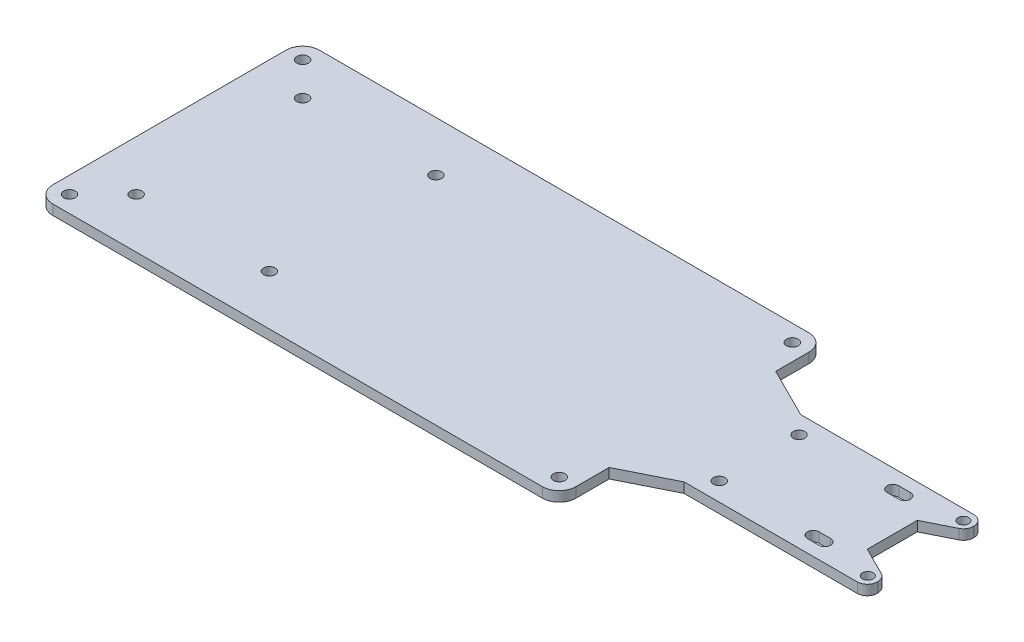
from build123d import *

# Parameters (mm, degrees)
SKETCH1_R               = 1.6
BOSS_EXTRUDE1_DEPTH     = 3
FILLET1_R               = 5
CUT_EXTRUDE1_DEPTH      = 231.516810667
CUT_EXTRUDE1_DEPTH_BACK = 231.516810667
SKETCH2_R               = 1.75
SKETCH3_R               = 1.75
CUT_EXTRUDE2_DEPTH      = 10
SKETCH4_R               = 1.75
CUT_EXTRUDE3_DEPTH      = 10


with BuildPart() as part:
    # Sketch1 → Boss-Extrude1 (new body)
    with BuildSketch(Plane(origin=(0, 0, 0), x_dir=(1, 0, 0), z_dir=(0, 1, 0))):
        with BuildLine():
            Line((0, -30), (0, 30))
            Line((0, 30), (0, 40))
            Line((0, 40), (77, 40))
            Line((77, 40), (157, 40))
            Line((157, 40), (157, 25))
            Line((157, 25), (172, 17.5))
            Line((172, 17.5), (224, 17.5))
            ThreePointArc((224, 17.5), (226.121320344, 16.621320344), (227, 14.5))
            Line((227, 14.5), (227, 14.354101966))
            ThreePointArc((227, 14.354101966), (226.551952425, 12.77690863), (225.341640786, 11.670820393))
            Line((225.341640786, 11.670820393), (217, 7.5))
            Line((217, 7.5), (217, -7.5))
            Line((217, -7.5), (225.341640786, -11.670820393))
            ThreePointArc((225.341640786, -11.670820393), (226.551952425, -12.77690863), (227, -14.354101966))
            Line((227, -14.354101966), (227, -14.5))
            ThreePointArc((227, -14.5), (226.121320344, -16.621320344), (224, -17.5))
            Line((224, -17.5), (172, -17.5))
            Line((172, -17.5), (157, -25))
            Line((157, -25), (157, -40))
            Line((157, -40), (77, -40))
            Line((77, -40), (0, -40))
            Line((0, -40), (0, -30))
        make_face()
        with Locations(Location((224, 14.354101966, 0), (0, 0, 270))):
            Circle(SKETCH1_R, mode=Mode.SUBTRACT)
        with Locations(Location((224, -14.354101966, 0), (0, 0, 90))):
            Circle(SKETCH1_R, mode=Mode.SUBTRACT)
    extrude(amount=BOSS_EXTRUDE1_DEPTH)

    # Fillet1
    fillet1_edges = [part.edges().sort_by_distance(p)[0] for p in [
        (157, 1.5, 40),
        (0, 1.5, 40),
        (0, 1.5, -40),
        (157, 1.5, -40),
    ]]
    fillet(fillet1_edges, radius=FILLET1_R)

    # Sketch2 → Cut-Extrude1 (cut, two sides: drawn at the far end of the back side and taken through both)
    with BuildSketch(Plane(origin=(0, 3, 0), x_dir=(1, 0, 0), z_dir=(0, 1, 0)).offset(-CUT_EXTRUDE1_DEPTH_BACK)):
        with Locations(Location((15, 25, 0), (0, 0, 270))):
            Circle(SKETCH2_R)
        with Locations(Location((55, 25, 0), (0, 0, 270))):
            Circle(SKETCH2_R)
        with Locations(Location((55, -25, 0), (0, 0, 270))):
            Circle(SKETCH2_R)
        with Locations(Location((15, -25, 0), (0, 0, 270))):
            Circle(SKETCH2_R)
    extrude(amount=CUT_EXTRUDE1_DEPTH + CUT_EXTRUDE1_DEPTH_BACK, mode=Mode.SUBTRACT)

    # Sketch3 → Cut-Extrude2 (cut)
    with BuildSketch(Plane(origin=(0, 3, 0), x_dir=(1, 0, 0), z_dir=(0, 1, 0))):
        with Locations(Location((5, 35, 0), (0, 0, 270))):
            Circle(SKETCH3_R)
        with Locations(Location((5, -35, 0), (0, 0, 270))):
            Circle(SKETCH3_R)
        with Locations(Location((152, 35, 0), (0, 0, 270))):
            Circle(SKETCH3_R)
        with Locations(Location((152, -35, 0), (0, 0, 270))):
            Circle(SKETCH3_R)
    extrude(amount=-CUT_EXTRUDE2_DEPTH, mode=Mode.SUBTRACT)

    # Sketch4 → Cut-Extrude3 (cut)
    with BuildSketch(Plane(origin=(0, 3, 0), x_dir=(1, 0, 0), z_dir=(0, 1, 0))):
        with Locations(Location((177.024019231, 11.975, 0), (0, 0, 270))):
            Circle(SKETCH4_R)
        with Locations(Location((177.024019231, -11.975, 0), (0, 0, 270))):
            Circle(SKETCH4_R)
        with BuildLine():
            Line((205.225980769, 13.725), (208.725980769, 13.725))
            ThreePointArc((208.725980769, 13.725), (210.475980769, 11.975), (208.725980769, 10.225))
            Line((208.725980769, 10.225), (205.225980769, 10.225))
            ThreePointArc((205.225980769, 10.225), (203.475980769, 11.975), (205.225980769, 13.725))
        make_face()
        with BuildLine():
            Line((205.225980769, -10.225), (208.725980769, -10.225))
            ThreePointArc((208.725980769, -10.225), (210.475980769, -11.975), (208.725980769, -13.725))
            Line((208.725980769, -13.725), (205.225980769, -13.725))
            ThreePointArc((205.225980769, -13.725), (203.475980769, -11.975), (205.225980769, -10.225))
        make_face()
    extrude(amount=-CUT_EXTRUDE3_DEPTH, mode=Mode.SUBTRACT)


solid = part.part
